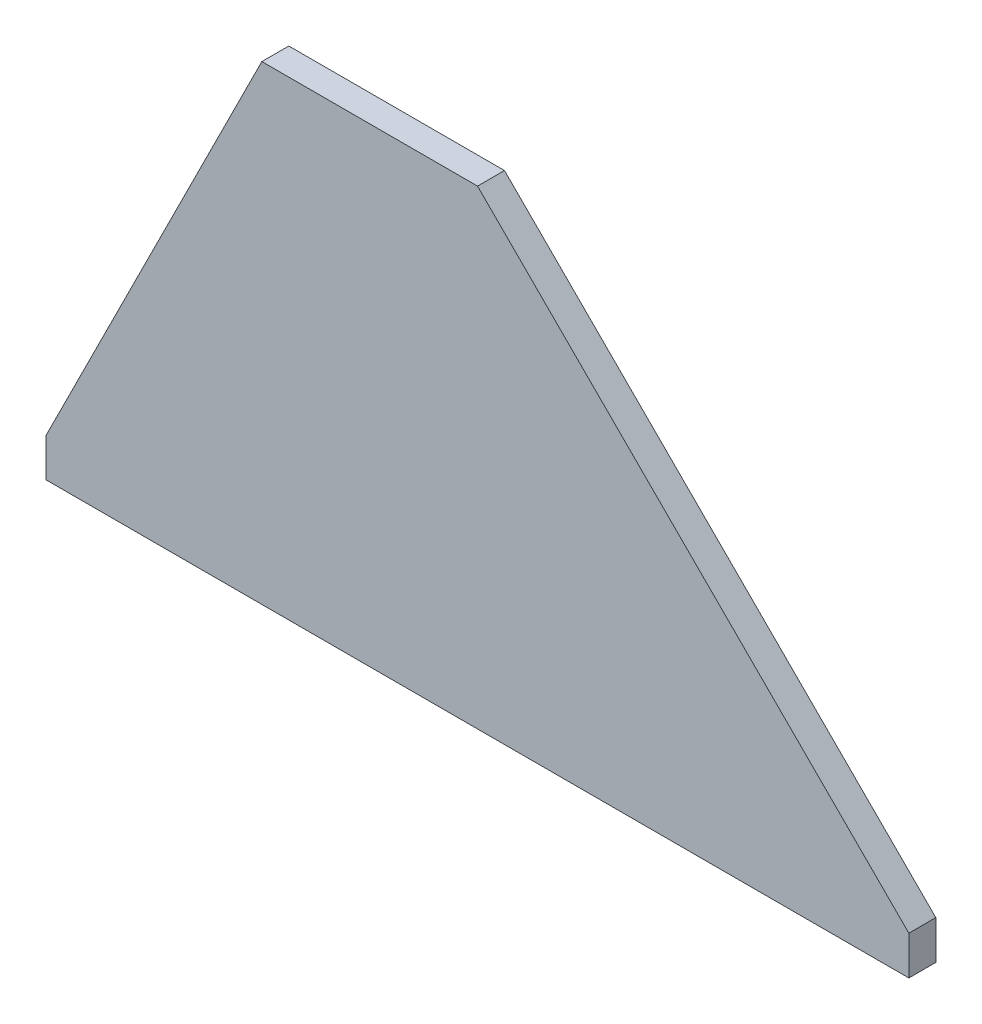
from build123d import *

# Parameters (mm, degrees)
EXTRUDE1_DEPTH = 3.175


with BuildPart() as part:
    # Sketch2 → Extrude1 (new body)
    with BuildSketch(Plane.XY):
        Polygon((101.6, 0), (50.8, 50.8), (25.4, 50.8), (0, 0), (0, -4.572), (101.6, -4.572), align=None)
    extrude(amount=EXTRUDE1_DEPTH)


solid = part.part
